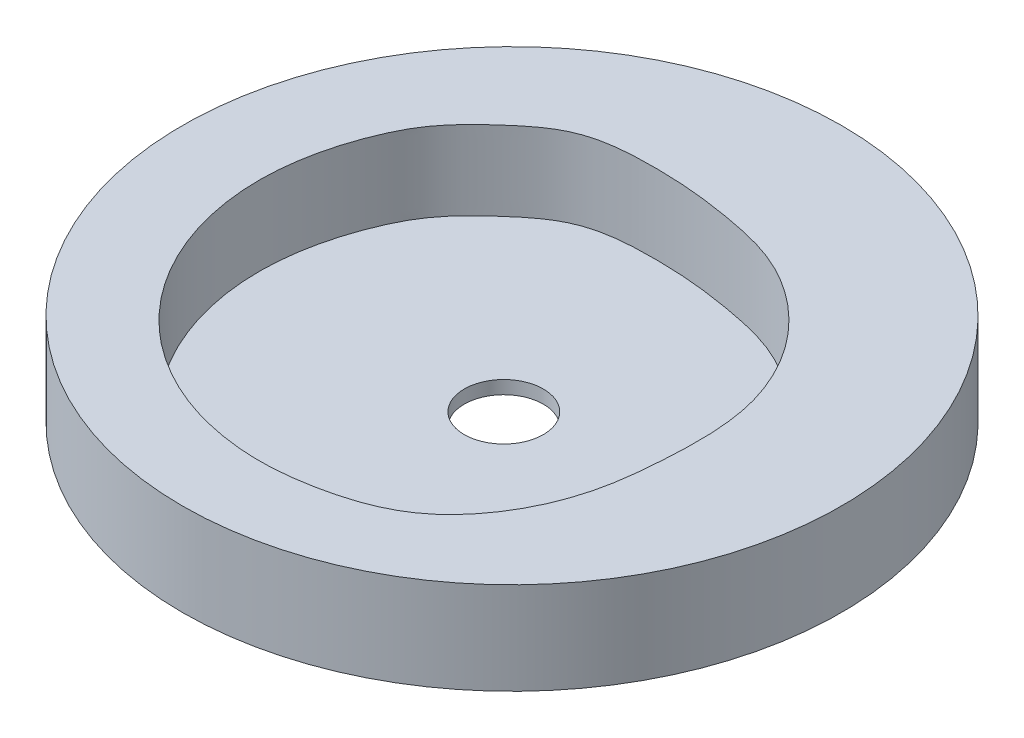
ISO-10303-21;
HEADER;
FILE_DESCRIPTION(('STEP AP214'),'2;1');
FILE_NAME('part.step','',(''),(''),'','','');
FILE_SCHEMA(('AUTOMOTIVE_DESIGN { 1 0 10303 214 1 1 1 1 }'));
ENDSEC;
DATA;
#1=APPLICATION_CONTEXT('core data for automotive mechanical design processes');
#2=APPLICATION_PROTOCOL_DEFINITION('international standard','automotive_design',2000,#1);
#3=PRODUCT_CONTEXT('',#1,'mechanical');
#4=PRODUCT('Part','Part','',(#3));
#5=PRODUCT_RELATED_PRODUCT_CATEGORY('part','',(#4));
#6=PRODUCT_DEFINITION_FORMATION('','',#4);
#7=PRODUCT_DEFINITION_CONTEXT('part definition',#1,'design');
#8=PRODUCT_DEFINITION('design','',#6,#7);
#9=PRODUCT_DEFINITION_SHAPE('','',#8);
#10=(LENGTH_UNIT() NAMED_UNIT(*) SI_UNIT(.MILLI.,.METRE.));
#11=(NAMED_UNIT(*) PLANE_ANGLE_UNIT() SI_UNIT($,.RADIAN.));
#12=(NAMED_UNIT(*) SI_UNIT($,.STERADIAN.) SOLID_ANGLE_UNIT());
#13=UNCERTAINTY_MEASURE_WITH_UNIT(LENGTH_MEASURE(1.E-05),#10,'distance_accuracy_value','');
#14=(GEOMETRIC_REPRESENTATION_CONTEXT(3) GLOBAL_UNCERTAINTY_ASSIGNED_CONTEXT((#13)) GLOBAL_UNIT_ASSIGNED_CONTEXT((#10,
#11,#12)) REPRESENTATION_CONTEXT('',''));
#15=CARTESIAN_POINT('',(0.,0.,0.));
#16=DIRECTION('',(0.,0.,1.));
#17=DIRECTION('',(1.,0.,0.));
#18=AXIS2_PLACEMENT_3D('',#15,#16,#17);
#19=CARTESIAN_POINT('',(0.,70.,0.));
#20=DIRECTION('',(0.,1.,0.));
#21=DIRECTION('',(0.,0.,1.));
#22=AXIS2_PLACEMENT_3D('',#19,#20,#21);
#23=PLANE('',#22);
#24=CARTESIAN_POINT('',(-45.060876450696,70.,185.63478267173));
#25=CARTESIAN_POINT('',(-33.2884984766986,70.,188.586789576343));
#26=CARTESIAN_POINT('',(-18.1882609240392,70.,190.825902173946));
#27=CARTESIAN_POINT('',(10.3968777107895,70.,191.552627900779));
#28=CARTESIAN_POINT('',(45.1782997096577,70.,187.313362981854));
#29=CARTESIAN_POINT('',(93.5059066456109,70.,171.674474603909));
#30=CARTESIAN_POINT('',(123.455959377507,70.,137.177404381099));
#31=CARTESIAN_POINT('',(139.008900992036,70.,106.533643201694));
#32=CARTESIAN_POINT('',(148.590100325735,70.,76.4217985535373));
#33=CARTESIAN_POINT('',(153.343669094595,70.,29.7600316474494));
#34=CARTESIAN_POINT('',(154.100642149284,70.,-26.6914433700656));
#35=CARTESIAN_POINT('',(130.171327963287,70.,-79.0407262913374));
#36=CARTESIAN_POINT('',(97.1320286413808,70.,-114.95851535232));
#37=CARTESIAN_POINT('',(59.6160273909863,70.,-137.137735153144));
#38=CARTESIAN_POINT('',(21.8361271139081,70.,-145.593183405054));
#39=CARTESIAN_POINT('',(-12.7904296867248,70.,-150.802289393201));
#40=CARTESIAN_POINT('',(-52.2948371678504,70.,-152.275526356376));
#41=CARTESIAN_POINT('',(-96.218904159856,70.,-148.958422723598));
#42=CARTESIAN_POINT('',(-130.914540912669,70.,-120.672762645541));
#43=CARTESIAN_POINT('',(-156.629334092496,70.,-95.4067018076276));
#44=CARTESIAN_POINT('',(-177.618482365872,70.,-52.4714124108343));
#45=CARTESIAN_POINT('',(-189.644046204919,70.,3.161009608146));
#46=CARTESIAN_POINT('',(-177.606421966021,70.,69.0452128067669));
#47=CARTESIAN_POINT('',(-150.210326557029,70.,118.111145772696));
#48=CARTESIAN_POINT('',(-115.082331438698,70.,153.500072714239));
#49=CARTESIAN_POINT('',(-79.6966966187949,70.,174.719087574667));
#50=CARTESIAN_POINT('',(-54.9229227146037,70.,183.161804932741));
#51=CARTESIAN_POINT('',(-45.060876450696,70.,185.63478267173));
#52=B_SPLINE_CURVE_WITH_KNOTS('',3,(#24,#25,#26,#27,#28,#29,#30,#31,#32,#33,#34,#35,#36,#37,#38,
#39,#40,#41,#42,#43,#44,#45,#46,#47,#48,#49,#50,#51),.UNSPECIFIED.,.T.,.F.,(4,1,1,1,1,1,1,1,1,1,
1,1,1,1,1,1,1,1,1,1,1,1,1,1,1,4),(0.,0.033549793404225,0.0419439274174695,0.0790971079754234,
0.130409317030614,0.17813738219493,0.200597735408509,0.225542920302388,0.264982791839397,
0.3303613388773,0.378658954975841,0.420200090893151,0.464033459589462,0.496717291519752,
0.526820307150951,0.560725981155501,0.606915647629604,0.643458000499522,0.681534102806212,
0.705910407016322,0.774648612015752,0.83510248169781,0.887171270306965,0.927826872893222,
0.971894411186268,1.),.UNSPECIFIED.);
#53=CARTESIAN_POINT('',(-45.060876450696,70.,185.63478267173));
#54=VERTEX_POINT('',#53);
#55=EDGE_CURVE('E46',#54,#54,#52,.T.);
#56=ORIENTED_EDGE('',*,*,#55,.F.);
#57=EDGE_LOOP('',(#56));
#58=FACE_BOUND('',#57,.T.);
#59=CARTESIAN_POINT('',(0.,70.,0.));
#60=DIRECTION('',(0.,1.,0.));
#61=DIRECTION('',(0.,0.,1.));
#62=AXIS2_PLACEMENT_3D('',#59,#60,#61);
#63=CIRCLE('',#62,250.);
#64=CARTESIAN_POINT('',(0.,70.,250.));
#65=VERTEX_POINT('',#64);
#66=EDGE_CURVE('E10',#65,#65,#63,.T.);
#67=ORIENTED_EDGE('',*,*,#66,.T.);
#68=EDGE_LOOP('',(#67));
#69=FACE_BOUND('',#68,.T.);
#70=ADVANCED_FACE('F30',(#58,#69),#23,.T.);
#71=CARTESIAN_POINT('',(0.,0.,0.));
#72=DIRECTION('',(0.,1.,0.));
#73=DIRECTION('',(0.,0.,1.));
#74=AXIS2_PLACEMENT_3D('',#71,#72,#73);
#75=PLANE('',#74);
#76=CARTESIAN_POINT('',(0.,0.,0.));
#77=DIRECTION('',(0.,1.,0.));
#78=DIRECTION('',(0.,0.,1.));
#79=AXIS2_PLACEMENT_3D('',#76,#77,#78);
#80=CIRCLE('',#79,250.);
#81=CARTESIAN_POINT('',(0.,0.,250.));
#82=VERTEX_POINT('',#81);
#83=EDGE_CURVE('E34',#82,#82,#80,.T.);
#84=ORIENTED_EDGE('',*,*,#83,.F.);
#85=EDGE_LOOP('',(#84));
#86=FACE_BOUND('',#85,.T.);
#87=CARTESIAN_POINT('',(0.,0.,6.20647550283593));
#88=DIRECTION('',(0.,1.,0.));
#89=DIRECTION('',(0.,0.,1.));
#90=AXIS2_PLACEMENT_3D('',#87,#88,#89);
#91=CIRCLE('',#90,30.);
#92=CARTESIAN_POINT('',(0.,0.,36.2064755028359));
#93=VERTEX_POINT('',#92);
#94=EDGE_CURVE('E41',#93,#93,#91,.T.);
#95=ORIENTED_EDGE('',*,*,#94,.T.);
#96=EDGE_LOOP('',(#95));
#97=FACE_BOUND('',#96,.T.);
#98=ADVANCED_FACE('F75',(#86,#97),#75,.F.);
#99=CARTESIAN_POINT('',(0.,70.,0.));
#100=DIRECTION('',(0.,-1.,0.));
#101=DIRECTION('',(0.,0.,-1.));
#102=AXIS2_PLACEMENT_3D('',#99,#100,#101);
#103=CYLINDRICAL_SURFACE('',#102,250.);
#104=ORIENTED_EDGE('',*,*,#66,.F.);
#105=EDGE_LOOP('',(#104));
#106=FACE_BOUND('',#105,.T.);
#107=ORIENTED_EDGE('',*,*,#83,.T.);
#108=EDGE_LOOP('',(#107));
#109=FACE_BOUND('',#108,.T.);
#110=ADVANCED_FACE('F32',(#106,#109),#103,.T.);
#111=CARTESIAN_POINT('',(0.,70.,6.20647550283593));
#112=DIRECTION('',(0.,-1.,0.));
#113=DIRECTION('',(0.,0.,-1.));
#114=AXIS2_PLACEMENT_3D('',#111,#112,#113);
#115=CYLINDRICAL_SURFACE('',#114,30.);
#116=CARTESIAN_POINT('',(0.,10.,6.20647550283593));
#117=DIRECTION('',(0.,1.,0.));
#118=DIRECTION('',(0.,0.,1.));
#119=AXIS2_PLACEMENT_3D('',#116,#117,#118);
#120=CIRCLE('',#119,30.);
#121=CARTESIAN_POINT('',(0.,10.,36.2064755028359));
#122=VERTEX_POINT('',#121);
#123=EDGE_CURVE('E51',#122,#122,#120,.T.);
#124=ORIENTED_EDGE('',*,*,#123,.T.);
#125=EDGE_LOOP('',(#124));
#126=FACE_BOUND('',#125,.T.);
#127=ORIENTED_EDGE('',*,*,#94,.F.);
#128=EDGE_LOOP('',(#127));
#129=FACE_BOUND('',#128,.T.);
#130=ADVANCED_FACE('F69',(#126,#129),#115,.F.);
#131=CARTESIAN_POINT('',(-45.060876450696,10.,185.63478267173));
#132=CARTESIAN_POINT('',(-33.2884984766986,10.,188.586789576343));
#133=CARTESIAN_POINT('',(-18.1882609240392,10.,190.825902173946));
#134=CARTESIAN_POINT('',(10.3968777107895,10.,191.552627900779));
#135=CARTESIAN_POINT('',(45.1782997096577,10.,187.313362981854));
#136=CARTESIAN_POINT('',(93.5059066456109,10.,171.674474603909));
#137=CARTESIAN_POINT('',(123.455959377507,10.,137.177404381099));
#138=CARTESIAN_POINT('',(139.008900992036,10.,106.533643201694));
#139=CARTESIAN_POINT('',(148.590100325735,10.,76.4217985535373));
#140=CARTESIAN_POINT('',(153.343669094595,10.,29.7600316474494));
#141=CARTESIAN_POINT('',(154.100642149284,10.,-26.6914433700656));
#142=CARTESIAN_POINT('',(130.171327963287,10.,-79.0407262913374));
#143=CARTESIAN_POINT('',(97.1320286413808,10.,-114.95851535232));
#144=CARTESIAN_POINT('',(59.6160273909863,10.,-137.137735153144));
#145=CARTESIAN_POINT('',(21.8361271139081,10.,-145.593183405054));
#146=CARTESIAN_POINT('',(-12.7904296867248,10.,-150.802289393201));
#147=CARTESIAN_POINT('',(-52.2948371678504,10.,-152.275526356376));
#148=CARTESIAN_POINT('',(-96.218904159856,10.,-148.958422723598));
#149=CARTESIAN_POINT('',(-130.914540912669,10.,-120.672762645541));
#150=CARTESIAN_POINT('',(-156.629334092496,10.,-95.4067018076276));
#151=CARTESIAN_POINT('',(-177.618482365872,10.,-52.4714124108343));
#152=CARTESIAN_POINT('',(-189.644046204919,10.,3.161009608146));
#153=CARTESIAN_POINT('',(-177.606421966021,10.,69.0452128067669));
#154=CARTESIAN_POINT('',(-150.210326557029,10.,118.111145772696));
#155=CARTESIAN_POINT('',(-115.082331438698,10.,153.500072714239));
#156=CARTESIAN_POINT('',(-79.6966966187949,10.,174.719087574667));
#157=CARTESIAN_POINT('',(-54.9229227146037,10.,183.161804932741));
#158=CARTESIAN_POINT('',(-45.060876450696,10.,185.63478267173));
#159=B_SPLINE_CURVE_WITH_KNOTS('',3,(#131,#132,#133,#134,#135,#136,#137,#138,#139,#140,#141,
#142,#143,#144,#145,#146,#147,#148,#149,#150,#151,#152,#153,#154,#155,#156,#157,#158),
.UNSPECIFIED.,.T.,.F.,(4,1,1,1,1,1,1,1,1,1,1,1,1,1,1,1,1,1,1,1,1,1,1,1,1,4),(0.,
0.033549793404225,0.0419439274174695,0.0790971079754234,0.130409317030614,0.17813738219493,
0.200597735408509,0.225542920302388,0.264982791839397,0.3303613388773,0.378658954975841,
0.420200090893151,0.464033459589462,0.496717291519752,0.526820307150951,0.560725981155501,
0.606915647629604,0.643458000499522,0.681534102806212,0.705910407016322,0.774648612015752,
0.83510248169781,0.887171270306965,0.927826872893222,0.971894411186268,1.),.UNSPECIFIED.);
#160=DIRECTION('',(0.,1.,0.));
#161=VECTOR('',#160,1.);
#162=SURFACE_OF_LINEAR_EXTRUSION('',#159,#161);
#163=CARTESIAN_POINT('',(-45.060876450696,10.,185.63478267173));
#164=VERTEX_POINT('',#163);
#165=EDGE_CURVE('E45',#164,#164,#159,.T.);
#166=ORIENTED_EDGE('',*,*,#165,.F.);
#167=EDGE_LOOP('',(#166));
#168=FACE_BOUND('',#167,.T.);
#169=ORIENTED_EDGE('',*,*,#55,.T.);
#170=EDGE_LOOP('',(#169));
#171=FACE_BOUND('',#170,.T.);
#172=ADVANCED_FACE('F64',(#168,#171),#162,.F.);
#173=CARTESIAN_POINT('',(17.3467196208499,10.,-146.002435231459));
#174=DIRECTION('',(0.,-1.,0.));
#175=DIRECTION('',(0.,0.,-1.));
#176=AXIS2_PLACEMENT_3D('',#173,#174,#175);
#177=PLANE('',#176);
#178=ORIENTED_EDGE('',*,*,#123,.F.);
#179=EDGE_LOOP('',(#178));
#180=FACE_BOUND('',#179,.T.);
#181=ORIENTED_EDGE('',*,*,#165,.T.);
#182=EDGE_LOOP('',(#181));
#183=FACE_BOUND('',#182,.T.);
#184=ADVANCED_FACE('F68',(#180,#183),#177,.F.);
#185=CLOSED_SHELL('',(#70,#98,#110,#130,#172,#184));
#186=MANIFOLD_SOLID_BREP('B2',#185);
#187=ADVANCED_BREP_SHAPE_REPRESENTATION('',(#18,#186),#14);
#188=SHAPE_DEFINITION_REPRESENTATION(#9,#187);
ENDSEC;
END-ISO-10303-21;
